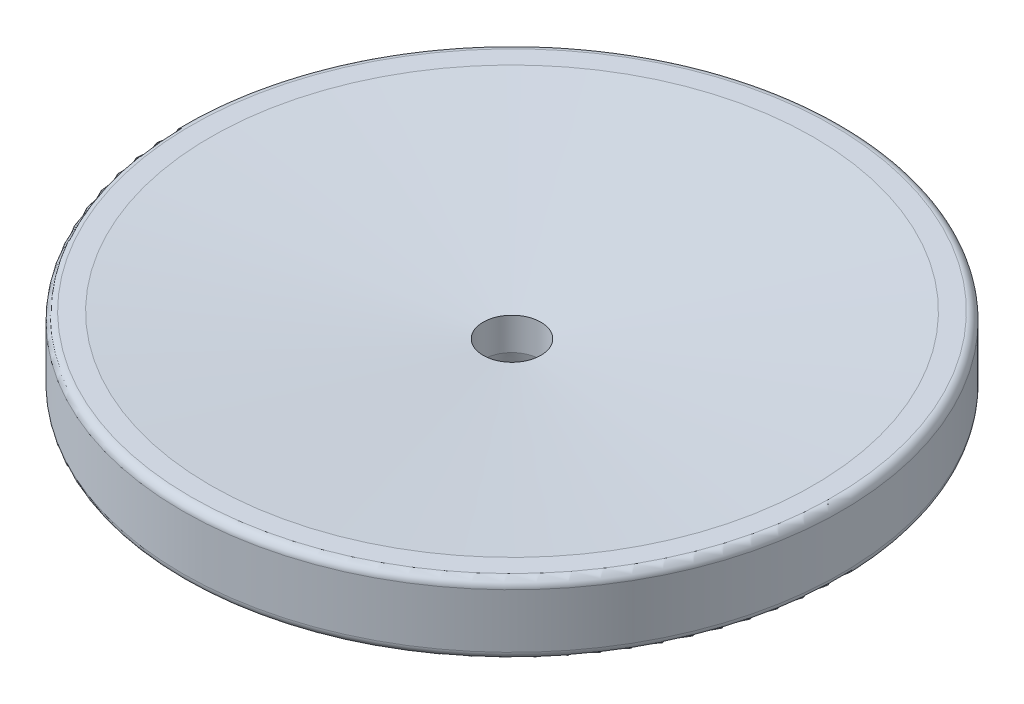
from build123d import *

# Parameters (mm, degrees)
SKETCH1_R                 = 63.5
BOSS_EXTRUDE1_DEPTH       = 13.6144
F_8_32_TAPPED_HOLE1_D     = 3.4544
F_8_32_TAPPED_HOLE1_DEPTH = 8.89
CIRPATTERN1_COUNT         = 12
FILLET1_R                 = 1.5875


with BuildPart() as part:
    # Sketch1 → Boss-Extrude1 (new body)
    with BuildSketch(Plane(origin=(0, 0, 0), x_dir=(1, 0, 0), z_dir=(0, 1, 0))):
        with Locations(Location((0, 0, 0), (0, 0, 270))):
            Circle(SKETCH1_R)
    extrude(amount=BOSS_EXTRUDE1_DEPTH)

    # Sketch4 → Cut-Revolve1 (revolve, cut)
    with BuildSketch(Plane.XY, mode=Mode.PRIVATE) as cut_revolve1_sk:
        with BuildLine():
            Line((-57.4294, 0), (-52.5526, 0))
            ThreePointArc((-52.5526, 0), (-52.642402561, 0.037197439), (-52.6796, 0.127))
            Line((-52.6796, 0.127), (-52.6796, 2.1971))
            ThreePointArc((-52.6796, 2.1971), (-52.809791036, 2.511408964), (-53.1241, 2.6416))
            Line((-53.1241, 2.6416), (-56.8579, 2.6416))
            ThreePointArc((-56.8579, 2.6416), (-57.172208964, 2.511408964), (-57.3024, 2.1971))
            Line((-57.3024, 2.1971), (-57.3024, 0.127))
            ThreePointArc((-57.3024, 0.127), (-57.339597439, 0.037197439), (-57.4294, 0))
        make_face()
    revolve(cut_revolve1_sk.sketch.rotate(Axis((0, 0, 0), (0, -1, 0)), 270), axis=Axis((0, 0, 0), (0, -1, 0)), mode=Mode.SUBTRACT)

    # 8-32 Tapped Hole1
    with Locations(Plane.XZ):
        with Locations((-23.9014, 41.398439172)):
            f_8_32_tapped_hole1 = Hole(F_8_32_TAPPED_HOLE1_D / 2, depth=F_8_32_TAPPED_HOLE1_DEPTH)

    # CirPattern1: 8-32 Tapped Hole1 ×12 about axis
    cirpattern1_axis = Axis((0, 0, 0), (0, 1, 0))
    for i in range(1, CIRPATTERN1_COUNT):
        add(f_8_32_tapped_hole1.rotate(cirpattern1_axis, i * 360 / CIRPATTERN1_COUNT), mode=Mode.SUBTRACT)

    # Fillet1
    fillet1_edges = [part.edges().sort_by_distance(p)[0] for p in [
        (0, 0, -63.5),
        (0, 13.6144, -63.5),
    ]]
    fillet(fillet1_edges, radius=FILLET1_R)

    # Port Sketch → SAE Port (revolve, cut)
    with BuildSketch(Plane(origin=(-1.877092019, 0, 1.000216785), x_dir=(0.8825283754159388, 0, -0.47025914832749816), z_dir=(0.47025914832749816, 0, 0.8825283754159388)), mode=Mode.PRIVATE) as sae_port_sk:
        with BuildLine():
            Line((2.126948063, 17.234641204), (7.087568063, 14.254))
            Line((7.087568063, 14.254), (7.087568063, 11.754))
            Line((7.087568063, 11.754), (7.683198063, 11.754))
            Line((7.683198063, 11.754), (7.683198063, 2.764417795))
            Line((7.683198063, 2.764417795), (7.593615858, 2.854))
            Line((7.593615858, 2.854), (8.103498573, 0.455190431))
            ThreePointArc((8.103498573, 0.455190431), (8.192100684, 0.310604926), (8.351948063, 0.254))
            Line((8.351948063, 0.254), (12.626948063, 0.254))
            Line((12.626948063, 0.254), (12.626948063, 0))
            Line((12.626948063, 0), (2.126948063, 0))
            Line((2.126948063, 0), (2.126948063, 17.234641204))
        make_face()
    revolve(sae_port_sk.sketch.rotate(Axis((0, 0, 0), (0, 1, 0)), 61.948880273), axis=Axis((0, 0, 0), (0, 1, 0)), mode=Mode.SUBTRACT)

    # Sketch23 → Cut-Revolve3 (revolve, cut)
    with BuildSketch(Plane.XY, mode=Mode.PRIVATE) as cut_revolve3_sk:
        with BuildLine():
            Line((-41.275, 0), (-41.275, 1.379184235))
            ThreePointArc((-41.275, 1.379184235), (-40.167340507, 3.788899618), (-37.61721844, 4.517264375))
            Line((-37.61721844, 4.517264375), (-8.255, 0))
            Line((-8.255, 0), (-41.275, 0))
        make_face()
        Polygon((-58.1025, 13.6144), (0, 13.6144), (0, 8.531089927), align=None)
    revolve(cut_revolve3_sk.sketch.rotate(Axis((0, 0, 0), (0, 1, 0)), 270), axis=Axis((0, 0, 0), (0, 1, 0)), mode=Mode.SUBTRACT)


solid = part.part
